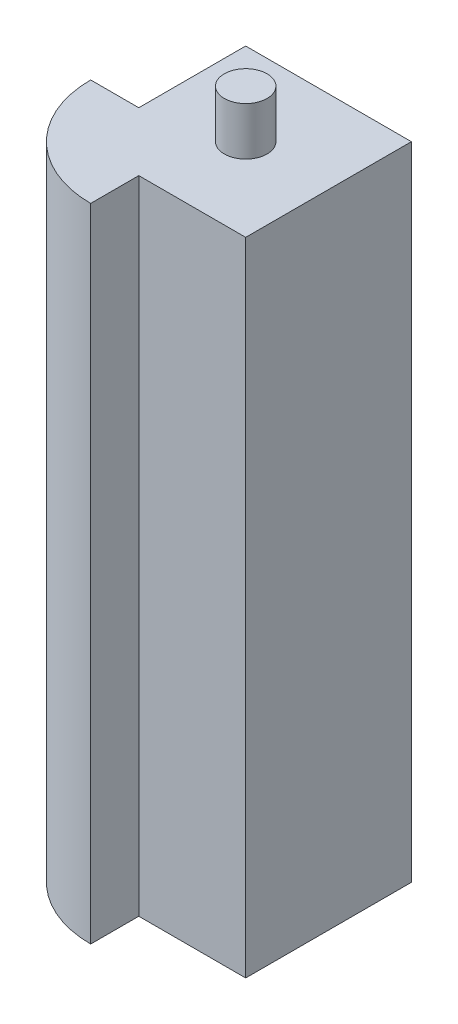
ISO-10303-21;
HEADER;
FILE_DESCRIPTION(('STEP AP214'),'2;1');
FILE_NAME('part.step','',(''),(''),'','','');
FILE_SCHEMA(('AUTOMOTIVE_DESIGN { 1 0 10303 214 1 1 1 1 }'));
ENDSEC;
DATA;
#1=APPLICATION_CONTEXT('core data for automotive mechanical design processes');
#2=APPLICATION_PROTOCOL_DEFINITION('international standard','automotive_design',2000,#1);
#3=PRODUCT_CONTEXT('',#1,'mechanical');
#4=PRODUCT('Part','Part','',(#3));
#5=PRODUCT_RELATED_PRODUCT_CATEGORY('part','',(#4));
#6=PRODUCT_DEFINITION_FORMATION('','',#4);
#7=PRODUCT_DEFINITION_CONTEXT('part definition',#1,'design');
#8=PRODUCT_DEFINITION('design','',#6,#7);
#9=PRODUCT_DEFINITION_SHAPE('','',#8);
#10=(LENGTH_UNIT() NAMED_UNIT(*) SI_UNIT(.MILLI.,.METRE.));
#11=(NAMED_UNIT(*) PLANE_ANGLE_UNIT() SI_UNIT($,.RADIAN.));
#12=(NAMED_UNIT(*) SI_UNIT($,.STERADIAN.) SOLID_ANGLE_UNIT());
#13=UNCERTAINTY_MEASURE_WITH_UNIT(LENGTH_MEASURE(1.E-05),#10,'distance_accuracy_value','');
#14=(GEOMETRIC_REPRESENTATION_CONTEXT(3) GLOBAL_UNCERTAINTY_ASSIGNED_CONTEXT((#13)) GLOBAL_UNIT_ASSIGNED_CONTEXT((#10,
#11,#12)) REPRESENTATION_CONTEXT('',''));
#15=CARTESIAN_POINT('',(0.,0.,0.));
#16=DIRECTION('',(0.,0.,1.));
#17=DIRECTION('',(1.,0.,0.));
#18=AXIS2_PLACEMENT_3D('',#15,#16,#17);
#19=CARTESIAN_POINT('',(10.,60.,0.));
#20=DIRECTION('',(1.,0.,0.));
#21=DIRECTION('',(0.,0.,-1.));
#22=AXIS2_PLACEMENT_3D('',#19,#20,#21);
#23=PLANE('',#22);
#24=DIRECTION('',(0.,0.,1.));
#25=VECTOR('',#24,1.);
#26=CARTESIAN_POINT('',(10.,0.,0.));
#27=LINE('',#26,#25);
#28=CARTESIAN_POINT('',(10.,0.,-10.));
#29=VERTEX_POINT('',#28);
#30=CARTESIAN_POINT('',(10.,0.,5.50000000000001));
#31=VERTEX_POINT('',#30);
#32=EDGE_CURVE('E137',#29,#31,#27,.T.);
#33=ORIENTED_EDGE('',*,*,#32,.F.);
#34=DIRECTION('',(0.,-1.,0.));
#35=VECTOR('',#34,1.);
#36=CARTESIAN_POINT('',(10.,60.,-10.));
#37=LINE('',#36,#35);
#38=CARTESIAN_POINT('',(10.,60.,-10.));
#39=VERTEX_POINT('',#38);
#40=EDGE_CURVE('E11',#39,#29,#37,.T.);
#41=ORIENTED_EDGE('',*,*,#40,.F.);
#42=DIRECTION('',(0.,0.,1.));
#43=VECTOR('',#42,1.);
#44=CARTESIAN_POINT('',(10.,60.,0.));
#45=LINE('',#44,#43);
#46=CARTESIAN_POINT('',(10.,60.,5.50000000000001));
#47=VERTEX_POINT('',#46);
#48=EDGE_CURVE('E155',#39,#47,#45,.T.);
#49=ORIENTED_EDGE('',*,*,#48,.T.);
#50=DIRECTION('',(0.,-1.,0.));
#51=VECTOR('',#50,1.);
#52=CARTESIAN_POINT('',(10.,60.,5.50000000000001));
#53=LINE('',#52,#51);
#54=EDGE_CURVE('E60',#47,#31,#53,.T.);
#55=ORIENTED_EDGE('',*,*,#54,.T.);
#56=EDGE_LOOP('',(#33,#41,#49,#55));
#57=FACE_BOUND('',#56,.T.);
#58=ADVANCED_FACE('F37',(#57),#23,.T.);
#59=CARTESIAN_POINT('',(0.,60.,-10.));
#60=DIRECTION('',(0.,0.,-1.));
#61=DIRECTION('',(-1.,0.,0.));
#62=AXIS2_PLACEMENT_3D('',#59,#60,#61);
#63=PLANE('',#62);
#64=DIRECTION('',(1.,0.,0.));
#65=VECTOR('',#64,1.);
#66=CARTESIAN_POINT('',(0.,0.,-10.));
#67=LINE('',#66,#65);
#68=CARTESIAN_POINT('',(-5.50000000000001,0.,-10.));
#69=VERTEX_POINT('',#68);
#70=EDGE_CURVE('E139',#69,#29,#67,.T.);
#71=ORIENTED_EDGE('',*,*,#70,.F.);
#72=DIRECTION('',(0.,-1.,0.));
#73=VECTOR('',#72,1.);
#74=CARTESIAN_POINT('',(-5.50000000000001,60.,-10.));
#75=LINE('',#74,#73);
#76=CARTESIAN_POINT('',(-5.50000000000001,60.,-10.));
#77=VERTEX_POINT('',#76);
#78=EDGE_CURVE('E44',#77,#69,#75,.T.);
#79=ORIENTED_EDGE('',*,*,#78,.F.);
#80=DIRECTION('',(1.,0.,0.));
#81=VECTOR('',#80,1.);
#82=CARTESIAN_POINT('',(0.,60.,-10.));
#83=LINE('',#82,#81);
#84=EDGE_CURVE('E175',#77,#39,#83,.T.);
#85=ORIENTED_EDGE('',*,*,#84,.T.);
#86=ORIENTED_EDGE('',*,*,#40,.T.);
#87=EDGE_LOOP('',(#71,#79,#85,#86));
#88=FACE_BOUND('',#87,.T.);
#89=ADVANCED_FACE('F169',(#88),#63,.T.);
#90=CARTESIAN_POINT('',(-5.50000000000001,60.,0.));
#91=DIRECTION('',(-1.,0.,0.));
#92=DIRECTION('',(0.,0.,1.));
#93=AXIS2_PLACEMENT_3D('',#90,#91,#92);
#94=PLANE('',#93);
#95=DIRECTION('',(0.,0.,-1.));
#96=VECTOR('',#95,1.);
#97=CARTESIAN_POINT('',(-5.50000000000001,0.,0.));
#98=LINE('',#97,#96);
#99=CARTESIAN_POINT('',(-5.50000000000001,0.,0.));
#100=VERTEX_POINT('',#99);
#101=EDGE_CURVE('E143',#100,#69,#98,.T.);
#102=ORIENTED_EDGE('',*,*,#101,.F.);
#103=DIRECTION('',(0.,-1.,0.));
#104=VECTOR('',#103,1.);
#105=CARTESIAN_POINT('',(-5.50000000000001,60.,0.));
#106=LINE('',#105,#104);
#107=CARTESIAN_POINT('',(-5.50000000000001,60.,0.));
#108=VERTEX_POINT('',#107);
#109=EDGE_CURVE('E159',#108,#100,#106,.T.);
#110=ORIENTED_EDGE('',*,*,#109,.F.);
#111=DIRECTION('',(0.,0.,-1.));
#112=VECTOR('',#111,1.);
#113=CARTESIAN_POINT('',(-5.50000000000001,60.,0.));
#114=LINE('',#113,#112);
#115=EDGE_CURVE('E165',#108,#77,#114,.T.);
#116=ORIENTED_EDGE('',*,*,#115,.T.);
#117=ORIENTED_EDGE('',*,*,#78,.T.);
#118=EDGE_LOOP('',(#102,#110,#116,#117));
#119=FACE_BOUND('',#118,.T.);
#120=ADVANCED_FACE('F164',(#119),#94,.T.);
#121=CARTESIAN_POINT('',(0.,60.,0.));
#122=DIRECTION('',(0.,0.,-1.));
#123=DIRECTION('',(-1.,0.,0.));
#124=AXIS2_PLACEMENT_3D('',#121,#122,#123);
#125=PLANE('',#124);
#126=DIRECTION('',(1.,0.,0.));
#127=VECTOR('',#126,1.);
#128=CARTESIAN_POINT('',(0.,0.,0.));
#129=LINE('',#128,#127);
#130=CARTESIAN_POINT('',(-10.,0.,0.));
#131=VERTEX_POINT('',#130);
#132=EDGE_CURVE('E146',#131,#100,#129,.T.);
#133=ORIENTED_EDGE('',*,*,#132,.F.);
#134=DIRECTION('',(0.,-1.,0.));
#135=VECTOR('',#134,1.);
#136=CARTESIAN_POINT('',(-10.,60.,0.));
#137=LINE('',#136,#135);
#138=CARTESIAN_POINT('',(-10.,60.,0.));
#139=VERTEX_POINT('',#138);
#140=EDGE_CURVE('E128',#139,#131,#137,.T.);
#141=ORIENTED_EDGE('',*,*,#140,.F.);
#142=DIRECTION('',(1.,0.,0.));
#143=VECTOR('',#142,1.);
#144=CARTESIAN_POINT('',(0.,60.,0.));
#145=LINE('',#144,#143);
#146=EDGE_CURVE('E117',#139,#108,#145,.T.);
#147=ORIENTED_EDGE('',*,*,#146,.T.);
#148=ORIENTED_EDGE('',*,*,#109,.T.);
#149=EDGE_LOOP('',(#133,#141,#147,#148));
#150=FACE_BOUND('',#149,.T.);
#151=ADVANCED_FACE('F174',(#150),#125,.T.);
#152=CARTESIAN_POINT('',(0.,60.,0.));
#153=DIRECTION('',(0.,-1.,0.));
#154=DIRECTION('',(0.,0.,-1.));
#155=AXIS2_PLACEMENT_3D('',#152,#153,#154);
#156=CYLINDRICAL_SURFACE('',#155,10.);
#157=CARTESIAN_POINT('',(0.,0.,0.));
#158=DIRECTION('',(0.,1.,0.));
#159=DIRECTION('',(0.,0.,1.));
#160=AXIS2_PLACEMENT_3D('',#157,#158,#159);
#161=CIRCLE('',#160,10.);
#162=CARTESIAN_POINT('',(0.,0.,10.));
#163=VERTEX_POINT('',#162);
#164=EDGE_CURVE('E124',#131,#163,#161,.T.);
#165=ORIENTED_EDGE('',*,*,#164,.T.);
#166=DIRECTION('',(0.,-1.,0.));
#167=VECTOR('',#166,1.);
#168=CARTESIAN_POINT('',(0.,60.,10.));
#169=LINE('',#168,#167);
#170=CARTESIAN_POINT('',(0.,60.,10.));
#171=VERTEX_POINT('',#170);
#172=EDGE_CURVE('E121',#171,#163,#169,.T.);
#173=ORIENTED_EDGE('',*,*,#172,.F.);
#174=CARTESIAN_POINT('',(0.,60.,0.));
#175=DIRECTION('',(0.,1.,0.));
#176=DIRECTION('',(0.,0.,1.));
#177=AXIS2_PLACEMENT_3D('',#174,#175,#176);
#178=CIRCLE('',#177,10.);
#179=EDGE_CURVE('E108',#139,#171,#178,.T.);
#180=ORIENTED_EDGE('',*,*,#179,.F.);
#181=ORIENTED_EDGE('',*,*,#140,.T.);
#182=EDGE_LOOP('',(#165,#173,#180,#181));
#183=FACE_BOUND('',#182,.T.);
#184=ADVANCED_FACE('F122',(#183),#156,.T.);
#185=CARTESIAN_POINT('',(0.,60.,0.));
#186=DIRECTION('',(-1.,0.,0.));
#187=DIRECTION('',(0.,0.,1.));
#188=AXIS2_PLACEMENT_3D('',#185,#186,#187);
#189=PLANE('',#188);
#190=DIRECTION('',(0.,0.,-1.));
#191=VECTOR('',#190,1.);
#192=CARTESIAN_POINT('',(0.,0.,0.));
#193=LINE('',#192,#191);
#194=CARTESIAN_POINT('',(0.,0.,5.50000000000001));
#195=VERTEX_POINT('',#194);
#196=EDGE_CURVE('E150',#163,#195,#193,.T.);
#197=ORIENTED_EDGE('',*,*,#196,.T.);
#198=DIRECTION('',(0.,-1.,0.));
#199=VECTOR('',#198,1.);
#200=CARTESIAN_POINT('',(0.,60.,5.50000000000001));
#201=LINE('',#200,#199);
#202=CARTESIAN_POINT('',(0.,60.,5.50000000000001));
#203=VERTEX_POINT('',#202);
#204=EDGE_CURVE('E129',#203,#195,#201,.T.);
#205=ORIENTED_EDGE('',*,*,#204,.F.);
#206=DIRECTION('',(0.,0.,-1.));
#207=VECTOR('',#206,1.);
#208=CARTESIAN_POINT('',(0.,60.,0.));
#209=LINE('',#208,#207);
#210=EDGE_CURVE('E113',#171,#203,#209,.T.);
#211=ORIENTED_EDGE('',*,*,#210,.F.);
#212=ORIENTED_EDGE('',*,*,#172,.T.);
#213=EDGE_LOOP('',(#197,#205,#211,#212));
#214=FACE_BOUND('',#213,.T.);
#215=ADVANCED_FACE('F131',(#214),#189,.F.);
#216=CARTESIAN_POINT('',(0.,60.,5.50000000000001));
#217=DIRECTION('',(0.,0.,1.));
#218=DIRECTION('',(1.,0.,0.));
#219=AXIS2_PLACEMENT_3D('',#216,#217,#218);
#220=PLANE('',#219);
#221=DIRECTION('',(-1.,0.,0.));
#222=VECTOR('',#221,1.);
#223=CARTESIAN_POINT('',(0.,0.,5.50000000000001));
#224=LINE('',#223,#222);
#225=EDGE_CURVE('E152',#31,#195,#224,.T.);
#226=ORIENTED_EDGE('',*,*,#225,.F.);
#227=ORIENTED_EDGE('',*,*,#54,.F.);
#228=DIRECTION('',(-1.,0.,0.));
#229=VECTOR('',#228,1.);
#230=CARTESIAN_POINT('',(0.,60.,5.50000000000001));
#231=LINE('',#230,#229);
#232=EDGE_CURVE('E132',#47,#203,#231,.T.);
#233=ORIENTED_EDGE('',*,*,#232,.T.);
#234=ORIENTED_EDGE('',*,*,#204,.T.);
#235=EDGE_LOOP('',(#226,#227,#233,#234));
#236=FACE_BOUND('',#235,.T.);
#237=ADVANCED_FACE('F312',(#236),#220,.T.);
#238=CARTESIAN_POINT('',(0.,60.,0.));
#239=DIRECTION('',(0.,1.,0.));
#240=DIRECTION('',(0.,0.,1.));
#241=AXIS2_PLACEMENT_3D('',#238,#239,#240);
#242=PLANE('',#241);
#243=CARTESIAN_POINT('',(2.25,60.,-2.25));
#244=DIRECTION('',(0.,1.,0.));
#245=DIRECTION('',(0.,0.,1.));
#246=AXIS2_PLACEMENT_3D('',#243,#244,#245);
#247=CIRCLE('',#246,2.);
#248=CARTESIAN_POINT('',(2.25,60.,-0.249999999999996));
#249=VERTEX_POINT('',#248);
#250=EDGE_CURVE('E180',#249,#249,#247,.T.);
#251=ORIENTED_EDGE('',*,*,#250,.F.);
#252=EDGE_LOOP('',(#251));
#253=FACE_BOUND('',#252,.T.);
#254=ORIENTED_EDGE('',*,*,#48,.F.);
#255=ORIENTED_EDGE('',*,*,#84,.F.);
#256=ORIENTED_EDGE('',*,*,#115,.F.);
#257=ORIENTED_EDGE('',*,*,#146,.F.);
#258=ORIENTED_EDGE('',*,*,#179,.T.);
#259=ORIENTED_EDGE('',*,*,#210,.T.);
#260=ORIENTED_EDGE('',*,*,#232,.F.);
#261=EDGE_LOOP('',(#254,#255,#256,#257,#258,#259,#260));
#262=FACE_BOUND('',#261,.T.);
#263=ADVANCED_FACE('F110',(#253,#262),#242,.T.);
#264=CARTESIAN_POINT('',(0.,0.,0.));
#265=DIRECTION('',(0.,1.,0.));
#266=DIRECTION('',(0.,0.,1.));
#267=AXIS2_PLACEMENT_3D('',#264,#265,#266);
#268=PLANE('',#267);
#269=DIRECTION('',(-0.5,0.,-0.866025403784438));
#270=VECTOR('',#269,1.);
#271=CARTESIAN_POINT('',(-0.369310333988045,0.,0.213221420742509));
#272=LINE('',#271,#270);
#273=CARTESIAN_POINT('',(0.229274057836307,0.,1.25));
#274=VERTEX_POINT('',#273);
#275=CARTESIAN_POINT('',(-1.79145188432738,0.,-2.24999999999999));
#276=VERTEX_POINT('',#275);
#277=EDGE_CURVE('E215',#274,#276,#272,.T.);
#278=ORIENTED_EDGE('',*,*,#277,.F.);
#279=DIRECTION('',(-1.,0.,0.));
#280=VECTOR('',#279,1.);
#281=CARTESIAN_POINT('',(0.,0.,1.25));
#282=LINE('',#281,#280);
#283=CARTESIAN_POINT('',(4.27072594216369,0.,1.25));
#284=VERTEX_POINT('',#283);
#285=EDGE_CURVE('E51',#284,#274,#282,.T.);
#286=ORIENTED_EDGE('',*,*,#285,.F.);
#287=DIRECTION('',(-0.5,0.,0.866025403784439));
#288=VECTOR('',#287,1.);
#289=CARTESIAN_POINT('',(3.74431033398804,0.,2.16177857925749));
#290=LINE('',#289,#288);
#291=CARTESIAN_POINT('',(6.29145188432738,0.,-2.25));
#292=VERTEX_POINT('',#291);
#293=EDGE_CURVE('E202',#292,#284,#290,.T.);
#294=ORIENTED_EDGE('',*,*,#293,.F.);
#295=DIRECTION('',(0.5,0.,0.866025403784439));
#296=VECTOR('',#295,1.);
#297=CARTESIAN_POINT('',(5.69286749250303,0.,-3.28677857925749));
#298=LINE('',#297,#296);
#299=CARTESIAN_POINT('',(4.27072594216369,0.,-5.75));
#300=VERTEX_POINT('',#299);
#301=EDGE_CURVE('E206',#300,#292,#298,.T.);
#302=ORIENTED_EDGE('',*,*,#301,.F.);
#303=DIRECTION('',(1.,0.,0.));
#304=VECTOR('',#303,1.);
#305=CARTESIAN_POINT('',(0.,0.,-5.75));
#306=LINE('',#305,#304);
#307=CARTESIAN_POINT('',(0.229274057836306,0.,-5.75));
#308=VERTEX_POINT('',#307);
#309=EDGE_CURVE('E209',#308,#300,#306,.T.);
#310=ORIENTED_EDGE('',*,*,#309,.F.);
#311=DIRECTION('',(0.5,0.,-0.866025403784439));
#312=VECTOR('',#311,1.);
#313=CARTESIAN_POINT('',(-2.31786749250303,0.,-1.33822142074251));
#314=LINE('',#313,#312);
#315=EDGE_CURVE('E212',#276,#308,#314,.T.);
#316=ORIENTED_EDGE('',*,*,#315,.F.);
#317=EDGE_LOOP('',(#278,#286,#294,#302,#310,#316));
#318=FACE_BOUND('',#317,.T.);
#319=ORIENTED_EDGE('',*,*,#32,.T.);
#320=ORIENTED_EDGE('',*,*,#225,.T.);
#321=ORIENTED_EDGE('',*,*,#196,.F.);
#322=ORIENTED_EDGE('',*,*,#164,.F.);
#323=ORIENTED_EDGE('',*,*,#132,.T.);
#324=ORIENTED_EDGE('',*,*,#101,.T.);
#325=ORIENTED_EDGE('',*,*,#70,.T.);
#326=EDGE_LOOP('',(#319,#320,#321,#322,#323,#324,#325));
#327=FACE_BOUND('',#326,.T.);
#328=ADVANCED_FACE('F171',(#318,#327),#268,.F.);
#329=CARTESIAN_POINT('',(2.25,64.5,-2.25));
#330=DIRECTION('',(0.,-1.,0.));
#331=DIRECTION('',(0.,0.,-1.));
#332=AXIS2_PLACEMENT_3D('',#329,#330,#331);
#333=CYLINDRICAL_SURFACE('',#332,2.);
#334=CARTESIAN_POINT('',(2.25,64.5,-2.25));
#335=DIRECTION('',(0.,1.,0.));
#336=DIRECTION('',(0.,0.,1.));
#337=AXIS2_PLACEMENT_3D('',#334,#335,#336);
#338=CIRCLE('',#337,2.);
#339=CARTESIAN_POINT('',(2.25,64.5,-0.249999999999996));
#340=VERTEX_POINT('',#339);
#341=EDGE_CURVE('E140',#340,#340,#338,.T.);
#342=ORIENTED_EDGE('',*,*,#341,.F.);
#343=EDGE_LOOP('',(#342));
#344=FACE_BOUND('',#343,.T.);
#345=ORIENTED_EDGE('',*,*,#250,.T.);
#346=EDGE_LOOP('',(#345));
#347=FACE_BOUND('',#346,.T.);
#348=ADVANCED_FACE('F363',(#344,#347),#333,.T.);
#349=CARTESIAN_POINT('',(2.25,64.5,-2.25));
#350=DIRECTION('',(0.,1.,0.));
#351=DIRECTION('',(0.,0.,1.));
#352=AXIS2_PLACEMENT_3D('',#349,#350,#351);
#353=PLANE('',#352);
#354=ORIENTED_EDGE('',*,*,#341,.T.);
#355=EDGE_LOOP('',(#354));
#356=FACE_BOUND('',#355,.T.);
#357=ADVANCED_FACE('F368',(#356),#353,.T.);
#358=CARTESIAN_POINT('',(0.,3.5,1.25));
#359=DIRECTION('',(0.,0.,1.));
#360=DIRECTION('',(1.,0.,0.));
#361=AXIS2_PLACEMENT_3D('',#358,#359,#360);
#362=PLANE('',#361);
#363=ORIENTED_EDGE('',*,*,#285,.T.);
#364=DIRECTION('',(0.,-1.,0.));
#365=VECTOR('',#364,1.);
#366=CARTESIAN_POINT('',(0.229274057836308,3.5,1.25));
#367=LINE('',#366,#365);
#368=CARTESIAN_POINT('',(0.229274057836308,3.5,1.25));
#369=VERTEX_POINT('',#368);
#370=EDGE_CURVE('E186',#369,#274,#367,.T.);
#371=ORIENTED_EDGE('',*,*,#370,.F.);
#372=DIRECTION('',(-1.,0.,0.));
#373=VECTOR('',#372,1.);
#374=CARTESIAN_POINT('',(0.,3.5,1.25));
#375=LINE('',#374,#373);
#376=CARTESIAN_POINT('',(4.27072594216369,3.5,1.25));
#377=VERTEX_POINT('',#376);
#378=EDGE_CURVE('E205',#377,#369,#375,.T.);
#379=ORIENTED_EDGE('',*,*,#378,.F.);
#380=DIRECTION('',(0.,-1.,0.));
#381=VECTOR('',#380,1.);
#382=CARTESIAN_POINT('',(4.27072594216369,3.5,1.25));
#383=LINE('',#382,#381);
#384=EDGE_CURVE('E183',#377,#284,#383,.T.);
#385=ORIENTED_EDGE('',*,*,#384,.T.);
#386=EDGE_LOOP('',(#363,#371,#379,#385));
#387=FACE_BOUND('',#386,.T.);
#388=ADVANCED_FACE('F261',(#387),#362,.F.);
#389=CARTESIAN_POINT('',(3.74431033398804,3.5,2.16177857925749));
#390=DIRECTION('',(0.866025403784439,0.,0.5));
#391=DIRECTION('',(0.5,0.,-0.866025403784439));
#392=AXIS2_PLACEMENT_3D('',#389,#390,#391);
#393=PLANE('',#392);
#394=ORIENTED_EDGE('',*,*,#293,.T.);
#395=ORIENTED_EDGE('',*,*,#384,.F.);
#396=DIRECTION('',(-0.5,0.,0.866025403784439));
#397=VECTOR('',#396,1.);
#398=CARTESIAN_POINT('',(3.74431033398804,3.5,2.16177857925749));
#399=LINE('',#398,#397);
#400=CARTESIAN_POINT('',(6.29145188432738,3.5,-2.25));
#401=VERTEX_POINT('',#400);
#402=EDGE_CURVE('E189',#401,#377,#399,.T.);
#403=ORIENTED_EDGE('',*,*,#402,.F.);
#404=DIRECTION('',(0.,-1.,0.));
#405=VECTOR('',#404,1.);
#406=CARTESIAN_POINT('',(6.29145188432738,3.5,-2.25));
#407=LINE('',#406,#405);
#408=EDGE_CURVE('E198',#401,#292,#407,.T.);
#409=ORIENTED_EDGE('',*,*,#408,.T.);
#410=EDGE_LOOP('',(#394,#395,#403,#409));
#411=FACE_BOUND('',#410,.T.);
#412=ADVANCED_FACE('F277',(#411),#393,.F.);
#413=CARTESIAN_POINT('',(5.69286749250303,3.5,-3.28677857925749));
#414=DIRECTION('',(0.866025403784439,0.,-0.5));
#415=DIRECTION('',(-0.5,0.,-0.866025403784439));
#416=AXIS2_PLACEMENT_3D('',#413,#414,#415);
#417=PLANE('',#416);
#418=ORIENTED_EDGE('',*,*,#301,.T.);
#419=ORIENTED_EDGE('',*,*,#408,.F.);
#420=DIRECTION('',(0.5,0.,0.866025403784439));
#421=VECTOR('',#420,1.);
#422=CARTESIAN_POINT('',(5.69286749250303,3.5,-3.28677857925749));
#423=LINE('',#422,#421);
#424=CARTESIAN_POINT('',(4.27072594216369,3.5,-5.75));
#425=VERTEX_POINT('',#424);
#426=EDGE_CURVE('E222',#425,#401,#423,.T.);
#427=ORIENTED_EDGE('',*,*,#426,.F.);
#428=DIRECTION('',(0.,-1.,0.));
#429=VECTOR('',#428,1.);
#430=CARTESIAN_POINT('',(4.27072594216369,3.5,-5.75));
#431=LINE('',#430,#429);
#432=EDGE_CURVE('E195',#425,#300,#431,.T.);
#433=ORIENTED_EDGE('',*,*,#432,.T.);
#434=EDGE_LOOP('',(#418,#419,#427,#433));
#435=FACE_BOUND('',#434,.T.);
#436=ADVANCED_FACE('F282',(#435),#417,.F.);
#437=CARTESIAN_POINT('',(0.,3.5,-5.75));
#438=DIRECTION('',(0.,0.,-1.));
#439=DIRECTION('',(-1.,0.,0.));
#440=AXIS2_PLACEMENT_3D('',#437,#438,#439);
#441=PLANE('',#440);
#442=ORIENTED_EDGE('',*,*,#309,.T.);
#443=ORIENTED_EDGE('',*,*,#432,.F.);
#444=DIRECTION('',(1.,0.,0.));
#445=VECTOR('',#444,1.);
#446=CARTESIAN_POINT('',(0.,3.5,-5.75));
#447=LINE('',#446,#445);
#448=CARTESIAN_POINT('',(0.229274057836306,3.5,-5.75));
#449=VERTEX_POINT('',#448);
#450=EDGE_CURVE('E225',#449,#425,#447,.T.);
#451=ORIENTED_EDGE('',*,*,#450,.F.);
#452=DIRECTION('',(0.,-1.,0.));
#453=VECTOR('',#452,1.);
#454=CARTESIAN_POINT('',(0.229274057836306,3.5,-5.75));
#455=LINE('',#454,#453);
#456=EDGE_CURVE('E192',#449,#308,#455,.T.);
#457=ORIENTED_EDGE('',*,*,#456,.T.);
#458=EDGE_LOOP('',(#442,#443,#451,#457));
#459=FACE_BOUND('',#458,.T.);
#460=ADVANCED_FACE('F299',(#459),#441,.F.);
#461=CARTESIAN_POINT('',(-2.31786749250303,3.5,-1.33822142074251));
#462=DIRECTION('',(-0.866025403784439,0.,-0.5));
#463=DIRECTION('',(-0.5,0.,0.866025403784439));
#464=AXIS2_PLACEMENT_3D('',#461,#462,#463);
#465=PLANE('',#464);
#466=ORIENTED_EDGE('',*,*,#315,.T.);
#467=ORIENTED_EDGE('',*,*,#456,.F.);
#468=DIRECTION('',(0.5,0.,-0.866025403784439));
#469=VECTOR('',#468,1.);
#470=CARTESIAN_POINT('',(-2.31786749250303,3.5,-1.33822142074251));
#471=LINE('',#470,#469);
#472=CARTESIAN_POINT('',(-1.79145188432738,3.5,-2.24999999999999));
#473=VERTEX_POINT('',#472);
#474=EDGE_CURVE('E228',#473,#449,#471,.T.);
#475=ORIENTED_EDGE('',*,*,#474,.F.);
#476=DIRECTION('',(0.,-1.,0.));
#477=VECTOR('',#476,1.);
#478=CARTESIAN_POINT('',(-1.79145188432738,3.5,-2.24999999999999));
#479=LINE('',#478,#477);
#480=EDGE_CURVE('E188',#473,#276,#479,.T.);
#481=ORIENTED_EDGE('',*,*,#480,.T.);
#482=EDGE_LOOP('',(#466,#467,#475,#481));
#483=FACE_BOUND('',#482,.T.);
#484=ADVANCED_FACE('F295',(#483),#465,.F.);
#485=CARTESIAN_POINT('',(-0.369310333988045,3.5,0.213221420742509));
#486=DIRECTION('',(-0.866025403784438,0.,0.5));
#487=DIRECTION('',(0.5,0.,0.866025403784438));
#488=AXIS2_PLACEMENT_3D('',#485,#486,#487);
#489=PLANE('',#488);
#490=ORIENTED_EDGE('',*,*,#277,.T.);
#491=ORIENTED_EDGE('',*,*,#480,.F.);
#492=DIRECTION('',(-0.5,0.,-0.866025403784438));
#493=VECTOR('',#492,1.);
#494=CARTESIAN_POINT('',(-0.369310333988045,3.5,0.213221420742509));
#495=LINE('',#494,#493);
#496=EDGE_CURVE('E231',#369,#473,#495,.T.);
#497=ORIENTED_EDGE('',*,*,#496,.F.);
#498=ORIENTED_EDGE('',*,*,#370,.T.);
#499=EDGE_LOOP('',(#490,#491,#497,#498));
#500=FACE_BOUND('',#499,.T.);
#501=ADVANCED_FACE('F253',(#500),#489,.F.);
#502=CARTESIAN_POINT('',(0.,3.5,0.));
#503=DIRECTION('',(0.,-1.,0.));
#504=DIRECTION('',(0.,0.,-1.));
#505=AXIS2_PLACEMENT_3D('',#502,#503,#504);
#506=PLANE('',#505);
#507=CARTESIAN_POINT('',(2.25,3.5,-2.25));
#508=DIRECTION('',(0.,-1.,0.));
#509=DIRECTION('',(0.,0.,-1.));
#510=AXIS2_PLACEMENT_3D('',#507,#508,#509);
#511=CIRCLE('',#510,2.);
#512=CARTESIAN_POINT('',(2.25,3.5,-4.25));
#513=VERTEX_POINT('',#512);
#514=EDGE_CURVE('E236',#513,#513,#511,.T.);
#515=ORIENTED_EDGE('',*,*,#514,.F.);
#516=EDGE_LOOP('',(#515));
#517=FACE_BOUND('',#516,.T.);
#518=ORIENTED_EDGE('',*,*,#378,.T.);
#519=ORIENTED_EDGE('',*,*,#496,.T.);
#520=ORIENTED_EDGE('',*,*,#474,.T.);
#521=ORIENTED_EDGE('',*,*,#450,.T.);
#522=ORIENTED_EDGE('',*,*,#426,.T.);
#523=ORIENTED_EDGE('',*,*,#402,.T.);
#524=EDGE_LOOP('',(#518,#519,#520,#521,#522,#523));
#525=FACE_BOUND('',#524,.T.);
#526=ADVANCED_FACE('F247',(#517,#525),#506,.T.);
#527=CARTESIAN_POINT('',(2.25,13.5,-2.25));
#528=DIRECTION('',(0.,-1.,0.));
#529=DIRECTION('',(0.,0.,-1.));
#530=AXIS2_PLACEMENT_3D('',#527,#528,#529);
#531=CYLINDRICAL_SURFACE('',#530,2.);
#532=CARTESIAN_POINT('',(2.25,13.5,-2.25));
#533=DIRECTION('',(0.,-1.,0.));
#534=DIRECTION('',(0.,0.,-1.));
#535=AXIS2_PLACEMENT_3D('',#532,#533,#534);
#536=CIRCLE('',#535,2.);
#537=CARTESIAN_POINT('',(2.25,13.5,-4.25));
#538=VERTEX_POINT('',#537);
#539=EDGE_CURVE('E219',#538,#538,#536,.T.);
#540=ORIENTED_EDGE('',*,*,#539,.F.);
#541=EDGE_LOOP('',(#540));
#542=FACE_BOUND('',#541,.T.);
#543=ORIENTED_EDGE('',*,*,#514,.T.);
#544=EDGE_LOOP('',(#543));
#545=FACE_BOUND('',#544,.T.);
#546=ADVANCED_FACE('F244',(#542,#545),#531,.F.);
#547=CARTESIAN_POINT('',(2.25,13.5,-2.25));
#548=DIRECTION('',(0.,-1.,0.));
#549=DIRECTION('',(0.,0.,-1.));
#550=AXIS2_PLACEMENT_3D('',#547,#548,#549);
#551=PLANE('',#550);
#552=ORIENTED_EDGE('',*,*,#539,.T.);
#553=EDGE_LOOP('',(#552));
#554=FACE_BOUND('',#553,.T.);
#555=ADVANCED_FACE('F242',(#554),#551,.T.);
#556=CLOSED_SHELL('',(#58,#89,#120,#151,#184,#215,#237,#263,#328,#348,#357,#388,#412,#436,#460,
#484,#501,#526,#546,#555));
#557=MANIFOLD_SOLID_BREP('B2',#556);
#558=ADVANCED_BREP_SHAPE_REPRESENTATION('',(#18,#557),#14);
#559=SHAPE_DEFINITION_REPRESENTATION(#9,#558);
ENDSEC;
END-ISO-10303-21;
